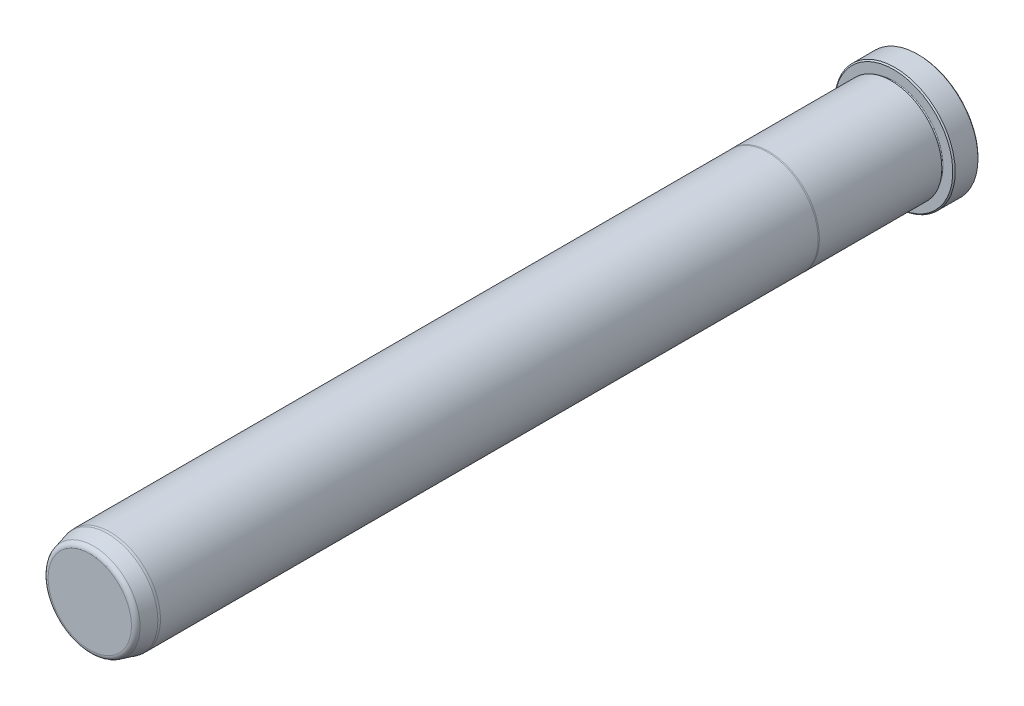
from build123d import *

# Parameters (mm, degrees)
FILLET6_R     = 1.5875
CHAMFER1_SIZE = 0.381


with BuildPart() as part:
    # Sketch1 → Revolve1 (revolve)
    with BuildSketch(Plane(origin=(0, 0, 0), x_dir=(0, 0, -1), z_dir=(1, 0, 0)), mode=Mode.PRIVATE) as revolve1_sk:
        with BuildLine():
            Line((0, 0), (0, 18.923))
            Line((0, 18.923), (-7.9248, 18.923))
            Line((-7.9248, 18.923), (-7.9248, 15.4813))
            ThreePointArc((-7.9248, 15.4813), (-8.3058, 15.1003), (-8.6868, 15.4813))
            Line((-8.6868, 15.4813), (-8.6868, 15.8877))
            Line((-8.6868, 15.8877), (-47.134763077, 15.8877))
            Line((-47.134763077, 15.8877), (-47.498, 15.8623))
            Line((-47.498, 15.8623), (-254, 15.8623))
            Line((-254, 15.8623), (-254.762, 15.795633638))
            Line((-254.762, 15.795633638), (-260.35, 14.298333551))
            Line((-260.35, 14.298333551), (-260.35, 0))
            Line((-260.35, 0), (0, 0))
        make_face()
    revolve(revolve1_sk.sketch.rotate(Axis((0, 0, 0), (0, 0, -1)), 90), axis=Axis((0, 0, 0), (0, 0, -1)))

    # Fillet6
    fillet6_edges = [part.edges().sort_by_distance(p)[0] for p in [
        (-14.298333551, 0, 260.35),
    ]]
    fillet(fillet6_edges, radius=FILLET6_R)

    # Chamfer1
    chamfer1_edges = [part.edges().sort_by_distance(p)[0] for p in [
        (-18.923, 0, 7.9248),
        (-18.923, 0, 0),
    ]]
    chamfer(chamfer1_edges, length=CHAMFER1_SIZE)


solid = part.part
